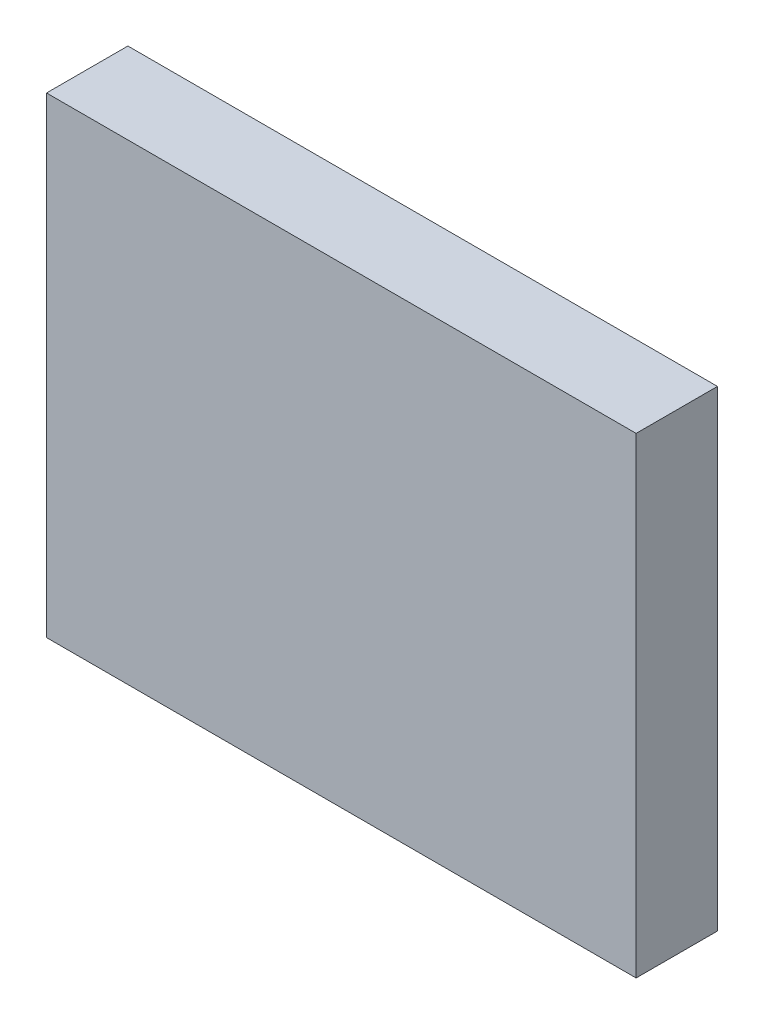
ISO-10303-21;
HEADER;
FILE_DESCRIPTION(('STEP AP214'),'2;1');
FILE_NAME('part.step','',(''),(''),'','','');
FILE_SCHEMA(('AUTOMOTIVE_DESIGN { 1 0 10303 214 1 1 1 1 }'));
ENDSEC;
DATA;
#1=APPLICATION_CONTEXT('core data for automotive mechanical design processes');
#2=APPLICATION_PROTOCOL_DEFINITION('international standard','automotive_design',2000,#1);
#3=PRODUCT_CONTEXT('',#1,'mechanical');
#4=PRODUCT('Part','Part','',(#3));
#5=PRODUCT_RELATED_PRODUCT_CATEGORY('part','',(#4));
#6=PRODUCT_DEFINITION_FORMATION('','',#4);
#7=PRODUCT_DEFINITION_CONTEXT('part definition',#1,'design');
#8=PRODUCT_DEFINITION('design','',#6,#7);
#9=PRODUCT_DEFINITION_SHAPE('','',#8);
#10=(LENGTH_UNIT() NAMED_UNIT(*) SI_UNIT(.MILLI.,.METRE.));
#11=(NAMED_UNIT(*) PLANE_ANGLE_UNIT() SI_UNIT($,.RADIAN.));
#12=(NAMED_UNIT(*) SI_UNIT($,.STERADIAN.) SOLID_ANGLE_UNIT());
#13=UNCERTAINTY_MEASURE_WITH_UNIT(LENGTH_MEASURE(1.E-05),#10,'distance_accuracy_value','');
#14=(GEOMETRIC_REPRESENTATION_CONTEXT(3) GLOBAL_UNCERTAINTY_ASSIGNED_CONTEXT((#13)) GLOBAL_UNIT_ASSIGNED_CONTEXT((#10,
#11,#12)) REPRESENTATION_CONTEXT('',''));
#15=CARTESIAN_POINT('',(0.,0.,0.));
#16=DIRECTION('',(0.,0.,1.));
#17=DIRECTION('',(1.,0.,0.));
#18=AXIS2_PLACEMENT_3D('',#15,#16,#17);
#19=CARTESIAN_POINT('',(200.,200.,139.873417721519));
#20=DIRECTION('',(-1.,0.,0.));
#21=DIRECTION('',(0.,-1.,0.));
#22=AXIS2_PLACEMENT_3D('',#19,#20,#21);
#23=PLANE('',#22);
#24=DIRECTION('',(0.,-1.,0.));
#25=VECTOR('',#24,1.);
#26=CARTESIAN_POINT('',(200.,-200.,70.886075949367));
#27=LINE('',#26,#25);
#28=CARTESIAN_POINT('',(200.,200.,70.886075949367));
#29=VERTEX_POINT('',#28);
#30=CARTESIAN_POINT('',(200.,-200.,70.886075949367));
#31=VERTEX_POINT('',#30);
#32=EDGE_CURVE('E45',#29,#31,#27,.T.);
#33=ORIENTED_EDGE('',*,*,#32,.F.);
#34=DIRECTION('',(0.,0.,-1.));
#35=VECTOR('',#34,1.);
#36=CARTESIAN_POINT('',(200.,200.,139.873417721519));
#37=LINE('',#36,#35);
#38=CARTESIAN_POINT('',(200.,200.,139.873417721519));
#39=VERTEX_POINT('',#38);
#40=EDGE_CURVE('E11',#39,#29,#37,.T.);
#41=ORIENTED_EDGE('',*,*,#40,.F.);
#42=DIRECTION('',(0.,1.,0.));
#43=VECTOR('',#42,1.);
#44=CARTESIAN_POINT('',(200.,200.,139.873417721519));
#45=LINE('',#44,#43);
#46=CARTESIAN_POINT('',(200.,-200.,139.873417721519));
#47=VERTEX_POINT('',#46);
#48=EDGE_CURVE('E90',#47,#39,#45,.T.);
#49=ORIENTED_EDGE('',*,*,#48,.F.);
#50=DIRECTION('',(0.,0.,-1.));
#51=VECTOR('',#50,1.);
#52=CARTESIAN_POINT('',(200.,-200.,139.873417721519));
#53=LINE('',#52,#51);
#54=EDGE_CURVE('E83',#47,#31,#53,.T.);
#55=ORIENTED_EDGE('',*,*,#54,.T.);
#56=EDGE_LOOP('',(#33,#41,#49,#55));
#57=FACE_BOUND('',#56,.T.);
#58=ADVANCED_FACE('F31',(#57),#23,.F.);
#59=CARTESIAN_POINT('',(-300.,200.,139.873417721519));
#60=DIRECTION('',(0.,-1.,0.));
#61=DIRECTION('',(1.,0.,0.));
#62=AXIS2_PLACEMENT_3D('',#59,#60,#61);
#63=PLANE('',#62);
#64=DIRECTION('',(1.,0.,0.));
#65=VECTOR('',#64,1.);
#66=CARTESIAN_POINT('',(200.,200.,70.886075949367));
#67=LINE('',#66,#65);
#68=CARTESIAN_POINT('',(-300.,200.,70.886075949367));
#69=VERTEX_POINT('',#68);
#70=EDGE_CURVE('E70',#69,#29,#67,.T.);
#71=ORIENTED_EDGE('',*,*,#70,.F.);
#72=DIRECTION('',(0.,0.,-1.));
#73=VECTOR('',#72,1.);
#74=CARTESIAN_POINT('',(-300.,200.,139.873417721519));
#75=LINE('',#74,#73);
#76=CARTESIAN_POINT('',(-300.,200.,139.873417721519));
#77=VERTEX_POINT('',#76);
#78=EDGE_CURVE('E38',#77,#69,#75,.T.);
#79=ORIENTED_EDGE('',*,*,#78,.F.);
#80=DIRECTION('',(-1.,0.,0.));
#81=VECTOR('',#80,1.);
#82=CARTESIAN_POINT('',(-300.,200.,139.873417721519));
#83=LINE('',#82,#81);
#84=EDGE_CURVE('E87',#39,#77,#83,.T.);
#85=ORIENTED_EDGE('',*,*,#84,.F.);
#86=ORIENTED_EDGE('',*,*,#40,.T.);
#87=EDGE_LOOP('',(#71,#79,#85,#86));
#88=FACE_BOUND('',#87,.T.);
#89=ADVANCED_FACE('F86',(#88),#63,.F.);
#90=CARTESIAN_POINT('',(-300.,-200.,139.873417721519));
#91=DIRECTION('',(1.,0.,0.));
#92=DIRECTION('',(0.,0.,-1.));
#93=AXIS2_PLACEMENT_3D('',#90,#91,#92);
#94=PLANE('',#93);
#95=DIRECTION('',(0.,1.,0.));
#96=VECTOR('',#95,1.);
#97=CARTESIAN_POINT('',(-300.,200.,70.886075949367));
#98=LINE('',#97,#96);
#99=CARTESIAN_POINT('',(-300.,-200.,70.886075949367));
#100=VERTEX_POINT('',#99);
#101=EDGE_CURVE('E74',#100,#69,#98,.T.);
#102=ORIENTED_EDGE('',*,*,#101,.F.);
#103=DIRECTION('',(0.,0.,-1.));
#104=VECTOR('',#103,1.);
#105=CARTESIAN_POINT('',(-300.,-200.,139.873417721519));
#106=LINE('',#105,#104);
#107=CARTESIAN_POINT('',(-300.,-200.,139.873417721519));
#108=VERTEX_POINT('',#107);
#109=EDGE_CURVE('E99',#108,#100,#106,.T.);
#110=ORIENTED_EDGE('',*,*,#109,.F.);
#111=DIRECTION('',(0.,-1.,0.));
#112=VECTOR('',#111,1.);
#113=CARTESIAN_POINT('',(-300.,-200.,139.873417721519));
#114=LINE('',#113,#112);
#115=EDGE_CURVE('E89',#77,#108,#114,.T.);
#116=ORIENTED_EDGE('',*,*,#115,.F.);
#117=ORIENTED_EDGE('',*,*,#78,.T.);
#118=EDGE_LOOP('',(#102,#110,#116,#117));
#119=FACE_BOUND('',#118,.T.);
#120=ADVANCED_FACE('F102',(#119),#94,.F.);
#121=CARTESIAN_POINT('',(200.,-200.,139.873417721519));
#122=DIRECTION('',(0.,1.,0.));
#123=DIRECTION('',(-1.,0.,0.));
#124=AXIS2_PLACEMENT_3D('',#121,#122,#123);
#125=PLANE('',#124);
#126=DIRECTION('',(-1.,0.,0.));
#127=VECTOR('',#126,1.);
#128=CARTESIAN_POINT('',(-300.,-200.,70.886075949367));
#129=LINE('',#128,#127);
#130=EDGE_CURVE('E84',#31,#100,#129,.T.);
#131=ORIENTED_EDGE('',*,*,#130,.F.);
#132=ORIENTED_EDGE('',*,*,#54,.F.);
#133=DIRECTION('',(1.,0.,0.));
#134=VECTOR('',#133,1.);
#135=CARTESIAN_POINT('',(200.,-200.,139.873417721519));
#136=LINE('',#135,#134);
#137=EDGE_CURVE('E53',#108,#47,#136,.T.);
#138=ORIENTED_EDGE('',*,*,#137,.F.);
#139=ORIENTED_EDGE('',*,*,#109,.T.);
#140=EDGE_LOOP('',(#131,#132,#138,#139));
#141=FACE_BOUND('',#140,.T.);
#142=ADVANCED_FACE('F105',(#141),#125,.F.);
#143=CARTESIAN_POINT('',(200.,-200.,139.873417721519));
#144=DIRECTION('',(0.,0.,-1.));
#145=DIRECTION('',(-1.,0.,0.));
#146=AXIS2_PLACEMENT_3D('',#143,#144,#145);
#147=PLANE('',#146);
#148=ORIENTED_EDGE('',*,*,#48,.T.);
#149=ORIENTED_EDGE('',*,*,#84,.T.);
#150=ORIENTED_EDGE('',*,*,#115,.T.);
#151=ORIENTED_EDGE('',*,*,#137,.T.);
#152=EDGE_LOOP('',(#148,#149,#150,#151));
#153=FACE_BOUND('',#152,.T.);
#154=ADVANCED_FACE('F92',(#153),#147,.F.);
#155=CARTESIAN_POINT('',(0.,0.,71.8987341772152));
#156=DIRECTION('',(0.,0.,1.));
#157=DIRECTION('',(0.,1.,0.));
#158=AXIS2_PLACEMENT_3D('',#155,#156,#157);
#159=TOROIDAL_SURFACE('',#158,65.3061303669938,2.0253164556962);
#160=CARTESIAN_POINT('',(0.,0.,69.873417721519));
#161=DIRECTION('',(0.,0.,-1.));
#162=DIRECTION('',(0.,-1.,0.));
#163=AXIS2_PLACEMENT_3D('',#160,#161,#162);
#164=CIRCLE('',#163,65.3061303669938);
#165=CARTESIAN_POINT('',(0.,-65.3061303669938,69.873417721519));
#166=VERTEX_POINT('',#165);
#167=EDGE_CURVE('E261',#166,#166,#164,.F.);
#168=ORIENTED_EDGE('',*,*,#167,.T.);
#169=EDGE_LOOP('',(#168));
#170=FACE_BOUND('',#169,.T.);
#171=CARTESIAN_POINT('',(0.,0.,70.8860759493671));
#172=DIRECTION('',(0.,0.,-1.));
#173=DIRECTION('',(0.,-1.,0.));
#174=AXIS2_PLACEMENT_3D('',#171,#172,#173);
#175=CIRCLE('',#174,67.0601058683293);
#176=CARTESIAN_POINT('',(0.,-67.0601058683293,70.8860759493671));
#177=VERTEX_POINT('',#176);
#178=EDGE_CURVE('E266',#177,#177,#175,.T.);
#179=ORIENTED_EDGE('',*,*,#178,.T.);
#180=EDGE_LOOP('',(#179));
#181=FACE_BOUND('',#180,.T.);
#182=ADVANCED_FACE('F112',(#170,#181),#159,.T.);
#183=CARTESIAN_POINT('',(65.8227848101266,0.,70.8860759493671));
#184=DIRECTION('',(0.,0.,-1.));
#185=DIRECTION('',(0.,-1.,0.));
#186=AXIS2_PLACEMENT_3D('',#183,#184,#185);
#187=PLANE('',#186);
#188=ORIENTED_EDGE('',*,*,#32,.T.);
#189=ORIENTED_EDGE('',*,*,#130,.T.);
#190=ORIENTED_EDGE('',*,*,#101,.T.);
#191=ORIENTED_EDGE('',*,*,#70,.T.);
#192=EDGE_LOOP('',(#188,#189,#190,#191));
#193=FACE_BOUND('',#192,.T.);
#194=ORIENTED_EDGE('',*,*,#178,.F.);
#195=EDGE_LOOP('',(#194));
#196=FACE_BOUND('',#195,.T.);
#197=ADVANCED_FACE('F71',(#193,#196),#187,.T.);
#198=CARTESIAN_POINT('',(200.,-200.,69.873417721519));
#199=DIRECTION('',(0.,0.,-1.));
#200=DIRECTION('',(-1.,0.,0.));
#201=AXIS2_PLACEMENT_3D('',#198,#199,#200);
#202=PLANE('',#201);
#203=ORIENTED_EDGE('',*,*,#167,.F.);
#204=EDGE_LOOP('',(#203));
#205=FACE_BOUND('',#204,.T.);
#206=CARTESIAN_POINT('',(0.,0.,69.873417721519));
#207=DIRECTION('',(0.,0.,-1.));
#208=DIRECTION('',(0.,-1.,0.));
#209=AXIS2_PLACEMENT_3D('',#206,#207,#208);
#210=CIRCLE('',#209,50.1207304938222);
#211=CARTESIAN_POINT('',(0.,-50.1207304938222,69.873417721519));
#212=VERTEX_POINT('',#211);
#213=EDGE_CURVE('E259',#212,#212,#210,.T.);
#214=ORIENTED_EDGE('',*,*,#213,.F.);
#215=EDGE_LOOP('',(#214));
#216=FACE_BOUND('',#215,.T.);
#217=ADVANCED_FACE('F151',(#205,#216),#202,.T.);
#218=CARTESIAN_POINT('',(0.,0.,87.9620253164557));
#219=DIRECTION('',(0.,0.,-1.));
#220=DIRECTION('',(-1.,0.,0.));
#221=AXIS2_PLACEMENT_3D('',#218,#219,#220);
#222=PLANE('',#221);
#223=CARTESIAN_POINT('',(0.,0.,87.9620253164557));
#224=DIRECTION('',(0.,0.,-1.));
#225=DIRECTION('',(-1.,0.,0.));
#226=AXIS2_PLACEMENT_3D('',#223,#224,#225);
#227=CIRCLE('',#226,11.0704167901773);
#228=CARTESIAN_POINT('',(-11.0704167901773,0.,87.9620253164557));
#229=VERTEX_POINT('',#228);
#230=EDGE_CURVE('E292',#229,#229,#227,.T.);
#231=ORIENTED_EDGE('',*,*,#230,.T.);
#232=EDGE_LOOP('',(#231));
#233=FACE_BOUND('',#232,.T.);
#234=ADVANCED_FACE('F160',(#233),#222,.T.);
#235=CARTESIAN_POINT('',(0.,0.,87.9620253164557));
#236=DIRECTION('',(0.,0.,-1.));
#237=DIRECTION('',(-1.,0.,0.));
#238=AXIS2_PLACEMENT_3D('',#235,#236,#237);
#239=CONICAL_SURFACE('',#238,11.0704167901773,0.174532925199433);
#240=CARTESIAN_POINT('',(0.,0.,76.9620253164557));
#241=DIRECTION('',(0.,0.,-1.));
#242=DIRECTION('',(-1.,0.,0.));
#243=AXIS2_PLACEMENT_3D('',#240,#241,#242);
#244=CIRCLE('',#243,13.0100135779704);
#245=CARTESIAN_POINT('',(-13.0100135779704,0.,76.9620253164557));
#246=VERTEX_POINT('',#245);
#247=EDGE_CURVE('E288',#246,#246,#244,.T.);
#248=ORIENTED_EDGE('',*,*,#247,.T.);
#249=EDGE_LOOP('',(#248));
#250=FACE_BOUND('',#249,.T.);
#251=ORIENTED_EDGE('',*,*,#230,.F.);
#252=EDGE_LOOP('',(#251));
#253=FACE_BOUND('',#252,.T.);
#254=ADVANCED_FACE('F169',(#250,#253),#239,.F.);
#255=CARTESIAN_POINT('',(33.4177215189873,0.,76.9620253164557));
#256=DIRECTION('',(0.,0.,1.));
#257=DIRECTION('',(0.,1.,0.));
#258=AXIS2_PLACEMENT_3D('',#255,#256,#257);
#259=PLANE('',#258);
#260=CARTESIAN_POINT('',(0.,0.,76.9620253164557));
#261=DIRECTION('',(0.,0.,1.));
#262=DIRECTION('',(0.,1.,0.));
#263=AXIS2_PLACEMENT_3D('',#260,#261,#262);
#264=CIRCLE('',#263,31.7020210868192);
#265=CARTESIAN_POINT('',(0.,31.7020210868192,76.9620253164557));
#266=VERTEX_POINT('',#265);
#267=EDGE_CURVE('E272',#266,#266,#264,.T.);
#268=ORIENTED_EDGE('',*,*,#267,.F.);
#269=EDGE_LOOP('',(#268));
#270=FACE_BOUND('',#269,.T.);
#271=ORIENTED_EDGE('',*,*,#247,.F.);
#272=EDGE_LOOP('',(#271));
#273=FACE_BOUND('',#272,.T.);
#274=ADVANCED_FACE('F179',(#270,#273),#259,.F.);
#275=CARTESIAN_POINT('',(0.,0.,78.9873417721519));
#276=DIRECTION('',(0.,0.,1.));
#277=DIRECTION('',(0.,1.,0.));
#278=AXIS2_PLACEMENT_3D('',#275,#276,#277);
#279=TOROIDAL_SURFACE('',#278,31.7020210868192,2.0253164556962);
#280=ORIENTED_EDGE('',*,*,#267,.T.);
#281=EDGE_LOOP('',(#280));
#282=FACE_BOUND('',#281,.T.);
#283=CARTESIAN_POINT('',(0.,0.,78.6543817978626));
#284=DIRECTION('',(0.,0.,1.));
#285=DIRECTION('',(0.,1.,0.));
#286=AXIS2_PLACEMENT_3D('',#283,#284,#285);
#287=CIRCLE('',#286,33.6997809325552);
#288=CARTESIAN_POINT('',(0.,33.6997809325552,78.6543817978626));
#289=VERTEX_POINT('',#288);
#290=EDGE_CURVE('E263',#289,#289,#287,.F.);
#291=ORIENTED_EDGE('',*,*,#290,.T.);
#292=EDGE_LOOP('',(#291));
#293=FACE_BOUND('',#292,.T.);
#294=ADVANCED_FACE('F189',(#282,#293),#279,.T.);
#295=CARTESIAN_POINT('',(0.,0.,101.26582278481));
#296=DIRECTION('',(0.,0.,1.));
#297=DIRECTION('',(0.,1.,0.));
#298=AXIS2_PLACEMENT_3D('',#295,#296,#297);
#299=CONICAL_SURFACE('',#298,37.4683544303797,0.165148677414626);
#300=ORIENTED_EDGE('',*,*,#290,.F.);
#301=EDGE_LOOP('',(#300));
#302=FACE_BOUND('',#301,.T.);
#303=CARTESIAN_POINT('',(0.,0.,101.26582278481));
#304=DIRECTION('',(0.,0.,-1.));
#305=DIRECTION('',(0.,-1.,0.));
#306=AXIS2_PLACEMENT_3D('',#303,#304,#305);
#307=CIRCLE('',#306,37.4683544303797);
#308=CARTESIAN_POINT('',(0.,-37.4683544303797,101.26582278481));
#309=VERTEX_POINT('',#308);
#310=EDGE_CURVE('E286',#309,#309,#307,.T.);
#311=ORIENTED_EDGE('',*,*,#310,.T.);
#312=EDGE_LOOP('',(#311));
#313=FACE_BOUND('',#312,.T.);
#314=ADVANCED_FACE('F199',(#302,#313),#299,.T.);
#315=CARTESIAN_POINT('',(0.,0.,101.26582278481));
#316=DIRECTION('',(0.,0.,-1.));
#317=DIRECTION('',(0.,-1.,0.));
#318=AXIS2_PLACEMENT_3D('',#315,#316,#317);
#319=PLANE('',#318);
#320=CARTESIAN_POINT('',(0.,0.,101.26582278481));
#321=DIRECTION('',(0.,0.,-1.));
#322=DIRECTION('',(0.,-1.,0.));
#323=AXIS2_PLACEMENT_3D('',#320,#321,#322);
#324=CIRCLE('',#323,45.1128328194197);
#325=CARTESIAN_POINT('',(0.,-45.1128328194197,101.26582278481));
#326=VERTEX_POINT('',#325);
#327=EDGE_CURVE('E278',#326,#326,#324,.F.);
#328=ORIENTED_EDGE('',*,*,#327,.F.);
#329=EDGE_LOOP('',(#328));
#330=FACE_BOUND('',#329,.T.);
#331=ORIENTED_EDGE('',*,*,#310,.F.);
#332=EDGE_LOOP('',(#331));
#333=FACE_BOUND('',#332,.T.);
#334=ADVANCED_FACE('F209',(#330,#333),#319,.T.);
#335=CARTESIAN_POINT('',(0.,0.,99.2405063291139));
#336=DIRECTION('',(0.,0.,-1.));
#337=DIRECTION('',(0.,-1.,0.));
#338=AXIS2_PLACEMENT_3D('',#335,#336,#337);
#339=TOROIDAL_SURFACE('',#338,45.1128328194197,2.0253164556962);
#340=ORIENTED_EDGE('',*,*,#327,.T.);
#341=EDGE_LOOP('',(#340));
#342=FACE_BOUND('',#341,.T.);
#343=CARTESIAN_POINT('',(0.,0.,99.311188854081));
#344=DIRECTION('',(0.,0.,1.));
#345=DIRECTION('',(0.,1.,0.));
#346=AXIS2_PLACEMENT_3D('',#343,#344,#345);
#347=CIRCLE('',#346,47.1369155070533);
#348=CARTESIAN_POINT('',(0.,47.1369155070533,99.311188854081));
#349=VERTEX_POINT('',#348);
#350=EDGE_CURVE('E275',#349,#349,#347,.F.);
#351=ORIENTED_EDGE('',*,*,#350,.T.);
#352=EDGE_LOOP('',(#351));
#353=FACE_BOUND('',#352,.T.);
#354=ADVANCED_FACE('F219',(#342,#353),#339,.F.);
#355=CARTESIAN_POINT('',(0.,0.,101.26582278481));
#356=DIRECTION('',(0.,0.,-1.));
#357=DIRECTION('',(0.,-1.,0.));
#358=AXIS2_PLACEMENT_3D('',#355,#356,#357);
#359=CONICAL_SURFACE('',#358,47.0686581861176,0.0349065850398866);
#360=ORIENTED_EDGE('',*,*,#350,.F.);
#361=EDGE_LOOP('',(#360));
#362=FACE_BOUND('',#361,.T.);
#363=CARTESIAN_POINT('',(0.,0.,71.8280516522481));
#364=DIRECTION('',(0.,0.,-1.));
#365=DIRECTION('',(0.,-1.,0.));
#366=AXIS2_PLACEMENT_3D('',#363,#364,#365);
#367=CIRCLE('',#366,48.0966478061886);
#368=CARTESIAN_POINT('',(0.,-48.0966478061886,71.8280516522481));
#369=VERTEX_POINT('',#368);
#370=EDGE_CURVE('E256',#369,#369,#367,.F.);
#371=ORIENTED_EDGE('',*,*,#370,.F.);
#372=EDGE_LOOP('',(#371));
#373=FACE_BOUND('',#372,.T.);
#374=ADVANCED_FACE('F229',(#362,#373),#359,.F.);
#375=CARTESIAN_POINT('',(0.,0.,71.8987341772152));
#376=DIRECTION('',(0.,0.,-1.));
#377=DIRECTION('',(0.,-1.,0.));
#378=AXIS2_PLACEMENT_3D('',#375,#376,#377);
#379=TOROIDAL_SURFACE('',#378,50.1207304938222,2.0253164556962);
#380=ORIENTED_EDGE('',*,*,#370,.T.);
#381=EDGE_LOOP('',(#380));
#382=FACE_BOUND('',#381,.T.);
#383=ORIENTED_EDGE('',*,*,#213,.T.);
#384=EDGE_LOOP('',(#383));
#385=FACE_BOUND('',#384,.T.);
#386=ADVANCED_FACE('F239',(#382,#385),#379,.T.);
#387=CLOSED_SHELL('',(#58,#89,#120,#142,#154,#182,#197,#217,#234,#254,#274,#294,#314,#334,#354,
#374,#386));
#388=MANIFOLD_SOLID_BREP('B2',#387);
#389=ADVANCED_BREP_SHAPE_REPRESENTATION('',(#18,#388),#14);
#390=SHAPE_DEFINITION_REPRESENTATION(#9,#389);
ENDSEC;
END-ISO-10303-21;
